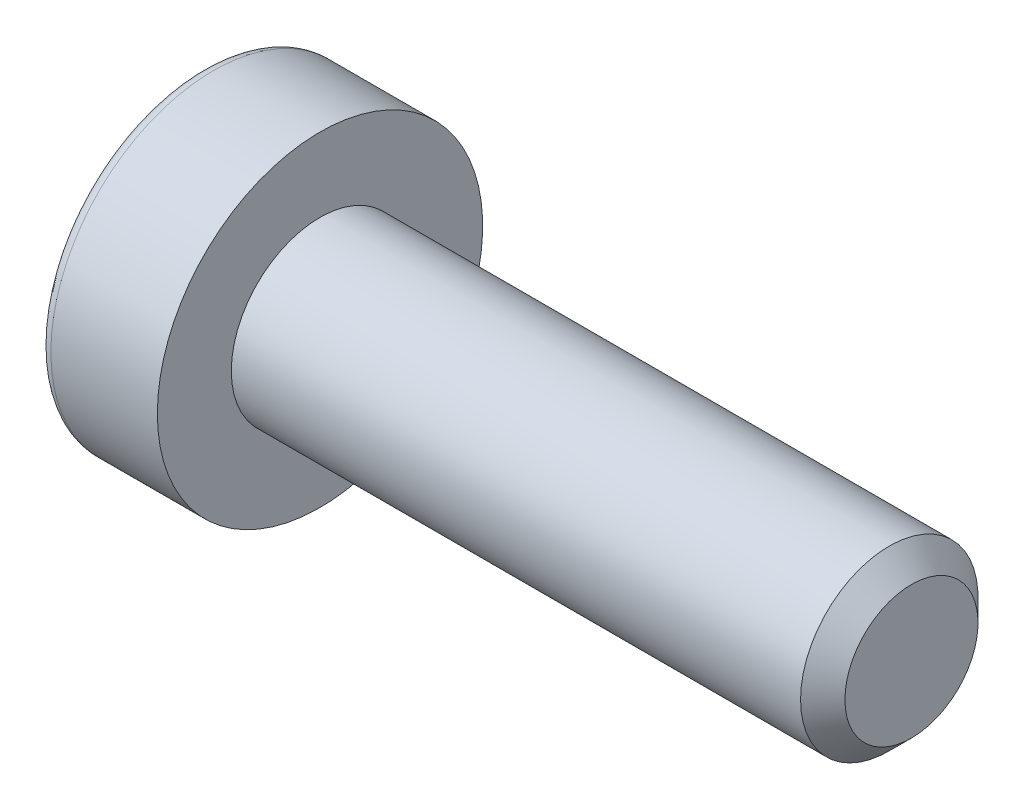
ISO-10303-21;
HEADER;
FILE_DESCRIPTION(('STEP AP214'),'2;1');
FILE_NAME('part.step','',(''),(''),'','','');
FILE_SCHEMA(('AUTOMOTIVE_DESIGN { 1 0 10303 214 1 1 1 1 }'));
ENDSEC;
DATA;
#1=APPLICATION_CONTEXT('core data for automotive mechanical design processes');
#2=APPLICATION_PROTOCOL_DEFINITION('international standard','automotive_design',2000,#1);
#3=PRODUCT_CONTEXT('',#1,'mechanical');
#4=PRODUCT('Part','Part','',(#3));
#5=PRODUCT_RELATED_PRODUCT_CATEGORY('part','',(#4));
#6=PRODUCT_DEFINITION_FORMATION('','',#4);
#7=PRODUCT_DEFINITION_CONTEXT('part definition',#1,'design');
#8=PRODUCT_DEFINITION('design','',#6,#7);
#9=PRODUCT_DEFINITION_SHAPE('','',#8);
#10=(LENGTH_UNIT() NAMED_UNIT(*) SI_UNIT(.MILLI.,.METRE.));
#11=(NAMED_UNIT(*) PLANE_ANGLE_UNIT() SI_UNIT($,.RADIAN.));
#12=(NAMED_UNIT(*) SI_UNIT($,.STERADIAN.) SOLID_ANGLE_UNIT());
#13=UNCERTAINTY_MEASURE_WITH_UNIT(LENGTH_MEASURE(1.E-05),#10,'distance_accuracy_value','');
#14=(GEOMETRIC_REPRESENTATION_CONTEXT(3) GLOBAL_UNCERTAINTY_ASSIGNED_CONTEXT((#13)) GLOBAL_UNIT_ASSIGNED_CONTEXT((#10,
#11,#12)) REPRESENTATION_CONTEXT('',''));
#15=CARTESIAN_POINT('',(0.,0.,0.));
#16=DIRECTION('',(0.,0.,1.));
#17=DIRECTION('',(1.,0.,0.));
#18=AXIS2_PLACEMENT_3D('',#15,#16,#17);
#19=CARTESIAN_POINT('',(0.,2.75000000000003,0.));
#20=DIRECTION('',(1.,0.,0.));
#21=DIRECTION('',(0.,0.,-1.));
#22=AXIS2_PLACEMENT_3D('',#19,#20,#21);
#23=PLANE('',#22);
#24=CARTESIAN_POINT('',(0.,0.,0.));
#25=DIRECTION('',(1.,0.,0.));
#26=DIRECTION('',(0.,0.,-1.));
#27=AXIS2_PLACEMENT_3D('',#24,#25,#26);
#28=CIRCLE('',#27,2.55);
#29=CARTESIAN_POINT('',(0.,0.,-2.55000000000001));
#30=VERTEX_POINT('',#29);
#31=EDGE_CURVE('E31',#30,#30,#28,.F.);
#32=ORIENTED_EDGE('',*,*,#31,.T.);
#33=EDGE_LOOP('',(#32));
#34=FACE_BOUND('',#33,.T.);
#35=DIRECTION('',(0.,-1.,0.));
#36=VECTOR('',#35,1.);
#37=CARTESIAN_POINT('',(0.,0.721687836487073,-1.25000000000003));
#38=LINE('',#37,#36);
#39=CARTESIAN_POINT('',(0.,0.721687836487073,-1.25000000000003));
#40=VERTEX_POINT('',#39);
#41=CARTESIAN_POINT('',(0.,-0.721687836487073,-1.24999999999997));
#42=VERTEX_POINT('',#41);
#43=EDGE_CURVE('E99',#40,#42,#38,.T.);
#44=ORIENTED_EDGE('',*,*,#43,.F.);
#45=DIRECTION('',(0.,-0.499999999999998,-0.866025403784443));
#46=VECTOR('',#45,1.);
#47=CARTESIAN_POINT('',(0.,1.44337567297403,0.));
#48=LINE('',#47,#46);
#49=CARTESIAN_POINT('',(0.,1.44337567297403,0.));
#50=VERTEX_POINT('',#49);
#51=EDGE_CURVE('E38',#50,#40,#48,.T.);
#52=ORIENTED_EDGE('',*,*,#51,.F.);
#53=DIRECTION('',(0.,0.499999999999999,-0.866025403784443));
#54=VECTOR('',#53,1.);
#55=CARTESIAN_POINT('',(0.,1.44337567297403,0.));
#56=LINE('',#55,#54);
#57=CARTESIAN_POINT('',(0.,0.721687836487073,1.25));
#58=VERTEX_POINT('',#57);
#59=EDGE_CURVE('E129',#58,#50,#56,.T.);
#60=ORIENTED_EDGE('',*,*,#59,.F.);
#61=DIRECTION('',(0.,1.,0.));
#62=VECTOR('',#61,1.);
#63=CARTESIAN_POINT('',(0.,0.721687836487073,1.25));
#64=LINE('',#63,#62);
#65=CARTESIAN_POINT('',(0.,-0.721687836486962,1.25));
#66=VERTEX_POINT('',#65);
#67=EDGE_CURVE('E124',#66,#58,#64,.T.);
#68=ORIENTED_EDGE('',*,*,#67,.F.);
#69=DIRECTION('',(0.,0.499999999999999,0.866025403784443));
#70=VECTOR('',#69,1.);
#71=CARTESIAN_POINT('',(0.,-0.721687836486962,1.25));
#72=LINE('',#71,#70);
#73=CARTESIAN_POINT('',(0.,-1.44337567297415,0.));
#74=VERTEX_POINT('',#73);
#75=EDGE_CURVE('E122',#74,#66,#72,.T.);
#76=ORIENTED_EDGE('',*,*,#75,.F.);
#77=DIRECTION('',(0.,-0.499999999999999,0.866025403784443));
#78=VECTOR('',#77,1.);
#79=CARTESIAN_POINT('',(0.,-0.721687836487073,-1.24999999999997));
#80=LINE('',#79,#78);
#81=EDGE_CURVE('E109',#42,#74,#80,.T.);
#82=ORIENTED_EDGE('',*,*,#81,.F.);
#83=EDGE_LOOP('',(#44,#52,#60,#68,#76,#82));
#84=FACE_BOUND('',#83,.T.);
#85=ADVANCED_FACE('F24',(#34,#84),#23,.F.);
#86=CARTESIAN_POINT('',(0.,0.,0.));
#87=DIRECTION('',(-1.,0.,0.));
#88=DIRECTION('',(0.,0.,1.));
#89=AXIS2_PLACEMENT_3D('',#86,#87,#88);
#90=CYLINDRICAL_SURFACE('',#89,2.75);
#91=CARTESIAN_POINT('',(0.199999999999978,0.,0.));
#92=DIRECTION('',(1.,0.,0.));
#93=DIRECTION('',(0.,0.,-1.));
#94=AXIS2_PLACEMENT_3D('',#91,#92,#93);
#95=CIRCLE('',#94,2.75);
#96=CARTESIAN_POINT('',(0.199999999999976,0.,-2.75000000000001));
#97=VERTEX_POINT('',#96);
#98=EDGE_CURVE('E11',#97,#97,#95,.T.);
#99=ORIENTED_EDGE('',*,*,#98,.T.);
#100=EDGE_LOOP('',(#99));
#101=FACE_BOUND('',#100,.T.);
#102=CARTESIAN_POINT('',(2.,0.,0.));
#103=DIRECTION('',(-1.,0.,0.));
#104=DIRECTION('',(0.,0.,1.));
#105=AXIS2_PLACEMENT_3D('',#102,#103,#104);
#106=CIRCLE('',#105,2.75);
#107=CARTESIAN_POINT('',(2.,0.,2.75000000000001));
#108=VERTEX_POINT('',#107);
#109=EDGE_CURVE('E169',#108,#108,#106,.T.);
#110=ORIENTED_EDGE('',*,*,#109,.T.);
#111=EDGE_LOOP('',(#110));
#112=FACE_BOUND('',#111,.T.);
#113=ADVANCED_FACE('F196',(#101,#112),#90,.T.);
#114=CARTESIAN_POINT('',(2.,1.49999999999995,0.));
#115=DIRECTION('',(-1.,0.,0.));
#116=DIRECTION('',(0.,0.,1.));
#117=AXIS2_PLACEMENT_3D('',#114,#115,#116);
#118=PLANE('',#117);
#119=ORIENTED_EDGE('',*,*,#109,.F.);
#120=EDGE_LOOP('',(#119));
#121=FACE_BOUND('',#120,.T.);
#122=CARTESIAN_POINT('',(2.,0.,0.));
#123=DIRECTION('',(-1.,0.,0.));
#124=DIRECTION('',(0.,0.,1.));
#125=AXIS2_PLACEMENT_3D('',#122,#123,#124);
#126=CIRCLE('',#125,1.5);
#127=CARTESIAN_POINT('',(2.,0.,1.50000000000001));
#128=VERTEX_POINT('',#127);
#129=EDGE_CURVE('E165',#128,#128,#126,.T.);
#130=ORIENTED_EDGE('',*,*,#129,.T.);
#131=EDGE_LOOP('',(#130));
#132=FACE_BOUND('',#131,.T.);
#133=ADVANCED_FACE('F201',(#121,#132),#118,.F.);
#134=CARTESIAN_POINT('',(0.,0.,0.));
#135=DIRECTION('',(-1.,0.,0.));
#136=DIRECTION('',(0.,0.,1.));
#137=AXIS2_PLACEMENT_3D('',#134,#135,#136);
#138=CYLINDRICAL_SURFACE('',#137,1.5);
#139=CARTESIAN_POINT('',(11.625,0.,0.));
#140=DIRECTION('',(-1.,0.,0.));
#141=DIRECTION('',(0.,0.,1.));
#142=AXIS2_PLACEMENT_3D('',#139,#140,#141);
#143=CIRCLE('',#142,1.5);
#144=CARTESIAN_POINT('',(11.625,0.,1.50000000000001));
#145=VERTEX_POINT('',#144);
#146=EDGE_CURVE('E172',#145,#145,#143,.T.);
#147=ORIENTED_EDGE('',*,*,#146,.T.);
#148=EDGE_LOOP('',(#147));
#149=FACE_BOUND('',#148,.T.);
#150=ORIENTED_EDGE('',*,*,#129,.F.);
#151=EDGE_LOOP('',(#150));
#152=FACE_BOUND('',#151,.T.);
#153=ADVANCED_FACE('F206',(#149,#152),#138,.T.);
#154=CARTESIAN_POINT('',(12.,0.,0.));
#155=DIRECTION('',(-1.,0.,0.));
#156=DIRECTION('',(0.,0.,1.));
#157=AXIS2_PLACEMENT_3D('',#154,#155,#156);
#158=PLANE('',#157);
#159=CARTESIAN_POINT('',(12.,0.,0.));
#160=DIRECTION('',(-1.,0.,0.));
#161=DIRECTION('',(0.,0.,1.));
#162=AXIS2_PLACEMENT_3D('',#159,#160,#161);
#163=CIRCLE('',#162,1.125);
#164=CARTESIAN_POINT('',(12.,0.,1.125));
#165=VERTEX_POINT('',#164);
#166=EDGE_CURVE('E175',#165,#165,#163,.F.);
#167=ORIENTED_EDGE('',*,*,#166,.T.);
#168=EDGE_LOOP('',(#167));
#169=FACE_BOUND('',#168,.T.);
#170=ADVANCED_FACE('F213',(#169),#158,.F.);
#171=CARTESIAN_POINT('',(11.625,0.,0.));
#172=DIRECTION('',(-1.,0.,0.));
#173=DIRECTION('',(0.,0.,1.));
#174=AXIS2_PLACEMENT_3D('',#171,#172,#173);
#175=CONICAL_SURFACE('',#174,1.5,0.785398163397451);
#176=ORIENTED_EDGE('',*,*,#166,.F.);
#177=EDGE_LOOP('',(#176));
#178=FACE_BOUND('',#177,.T.);
#179=ORIENTED_EDGE('',*,*,#146,.F.);
#180=EDGE_LOOP('',(#179));
#181=FACE_BOUND('',#180,.T.);
#182=ADVANCED_FACE('F217',(#178,#181),#175,.T.);
#183=CARTESIAN_POINT('',(1.,1.44337567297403,0.));
#184=DIRECTION('',(0.,0.866025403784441,-0.499999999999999));
#185=DIRECTION('',(0.,0.499999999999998,0.866025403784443));
#186=AXIS2_PLACEMENT_3D('',#183,#184,#185);
#187=PLANE('',#186);
#188=DIRECTION('',(0.,-0.499999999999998,-0.866025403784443));
#189=VECTOR('',#188,1.);
#190=CARTESIAN_POINT('',(1.,1.44337567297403,0.));
#191=LINE('',#190,#189);
#192=CARTESIAN_POINT('',(1.,1.44337567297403,0.));
#193=VERTEX_POINT('',#192);
#194=CARTESIAN_POINT('',(1.,1.08253175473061,-0.625000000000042));
#195=VERTEX_POINT('',#194);
#196=EDGE_CURVE('E132',#193,#195,#191,.T.);
#197=ORIENTED_EDGE('',*,*,#196,.F.);
#198=DIRECTION('',(-1.,0.,0.));
#199=VECTOR('',#198,1.);
#200=CARTESIAN_POINT('',(1.,1.44337567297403,0.));
#201=LINE('',#200,#199);
#202=EDGE_CURVE('E151',#193,#50,#201,.T.);
#203=ORIENTED_EDGE('',*,*,#202,.T.);
#204=ORIENTED_EDGE('',*,*,#51,.T.);
#205=DIRECTION('',(-1.,0.,0.));
#206=VECTOR('',#205,1.);
#207=CARTESIAN_POINT('',(1.,0.721687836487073,-1.25000000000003));
#208=LINE('',#207,#206);
#209=CARTESIAN_POINT('',(1.,0.721687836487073,-1.25000000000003));
#210=VERTEX_POINT('',#209);
#211=EDGE_CURVE('E106',#210,#40,#208,.T.);
#212=ORIENTED_EDGE('',*,*,#211,.F.);
#213=EDGE_CURVE('E131',#195,#210,#191,.T.);
#214=ORIENTED_EDGE('',*,*,#213,.F.);
#215=EDGE_LOOP('',(#197,#203,#204,#212,#214));
#216=FACE_BOUND('',#215,.T.);
#217=ADVANCED_FACE('F219',(#216),#187,.F.);
#218=CARTESIAN_POINT('',(1.,1.44337567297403,0.));
#219=DIRECTION('',(0.,0.866025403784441,0.499999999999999));
#220=DIRECTION('',(0.,-0.499999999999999,0.866025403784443));
#221=AXIS2_PLACEMENT_3D('',#218,#219,#220);
#222=PLANE('',#221);
#223=DIRECTION('',(0.,0.499999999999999,-0.866025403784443));
#224=VECTOR('',#223,1.);
#225=CARTESIAN_POINT('',(1.,1.44337567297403,0.));
#226=LINE('',#225,#224);
#227=CARTESIAN_POINT('',(1.,0.721687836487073,1.25));
#228=VERTEX_POINT('',#227);
#229=CARTESIAN_POINT('',(1.,1.08253175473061,0.625000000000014));
#230=VERTEX_POINT('',#229);
#231=EDGE_CURVE('E148',#228,#230,#226,.T.);
#232=ORIENTED_EDGE('',*,*,#231,.F.);
#233=DIRECTION('',(-1.,0.,0.));
#234=VECTOR('',#233,1.);
#235=CARTESIAN_POINT('',(1.,0.721687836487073,1.25));
#236=LINE('',#235,#234);
#237=EDGE_CURVE('E154',#228,#58,#236,.T.);
#238=ORIENTED_EDGE('',*,*,#237,.T.);
#239=ORIENTED_EDGE('',*,*,#59,.T.);
#240=ORIENTED_EDGE('',*,*,#202,.F.);
#241=EDGE_CURVE('E147',#230,#193,#226,.T.);
#242=ORIENTED_EDGE('',*,*,#241,.F.);
#243=EDGE_LOOP('',(#232,#238,#239,#240,#242));
#244=FACE_BOUND('',#243,.T.);
#245=ADVANCED_FACE('F224',(#244),#222,.F.);
#246=CARTESIAN_POINT('',(1.,0.721687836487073,1.25));
#247=DIRECTION('',(0.,0.,1.));
#248=DIRECTION('',(1.,0.,0.));
#249=AXIS2_PLACEMENT_3D('',#246,#247,#248);
#250=PLANE('',#249);
#251=DIRECTION('',(0.,1.,0.));
#252=VECTOR('',#251,1.);
#253=CARTESIAN_POINT('',(1.,0.721687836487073,1.25));
#254=LINE('',#253,#252);
#255=CARTESIAN_POINT('',(1.,-0.721687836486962,1.25));
#256=VERTEX_POINT('',#255);
#257=CARTESIAN_POINT('',(1.,0.,1.24999999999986));
#258=VERTEX_POINT('',#257);
#259=EDGE_CURVE('E46',#256,#258,#254,.T.);
#260=ORIENTED_EDGE('',*,*,#259,.F.);
#261=DIRECTION('',(-1.,0.,0.));
#262=VECTOR('',#261,1.);
#263=CARTESIAN_POINT('',(1.,-0.721687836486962,1.25));
#264=LINE('',#263,#262);
#265=EDGE_CURVE('E157',#256,#66,#264,.T.);
#266=ORIENTED_EDGE('',*,*,#265,.T.);
#267=ORIENTED_EDGE('',*,*,#67,.T.);
#268=ORIENTED_EDGE('',*,*,#237,.F.);
#269=EDGE_CURVE('E145',#258,#228,#254,.T.);
#270=ORIENTED_EDGE('',*,*,#269,.F.);
#271=EDGE_LOOP('',(#260,#266,#267,#268,#270));
#272=FACE_BOUND('',#271,.T.);
#273=ADVANCED_FACE('F233',(#272),#250,.F.);
#274=CARTESIAN_POINT('',(1.,-0.721687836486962,1.25));
#275=DIRECTION('',(0.,-0.866025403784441,0.500000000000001));
#276=DIRECTION('',(0.,-0.499999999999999,-0.866025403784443));
#277=AXIS2_PLACEMENT_3D('',#274,#275,#276);
#278=PLANE('',#277);
#279=DIRECTION('',(0.,0.499999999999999,0.866025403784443));
#280=VECTOR('',#279,1.);
#281=CARTESIAN_POINT('',(1.,-0.721687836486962,1.25));
#282=LINE('',#281,#280);
#283=CARTESIAN_POINT('',(1.,-1.44337567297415,0.));
#284=VERTEX_POINT('',#283);
#285=CARTESIAN_POINT('',(1.,-1.08253175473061,0.624999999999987));
#286=VERTEX_POINT('',#285);
#287=EDGE_CURVE('E142',#284,#286,#282,.T.);
#288=ORIENTED_EDGE('',*,*,#287,.F.);
#289=DIRECTION('',(-1.,0.,0.));
#290=VECTOR('',#289,1.);
#291=CARTESIAN_POINT('',(1.,-1.44337567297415,0.));
#292=LINE('',#291,#290);
#293=EDGE_CURVE('E118',#284,#74,#292,.T.);
#294=ORIENTED_EDGE('',*,*,#293,.T.);
#295=ORIENTED_EDGE('',*,*,#75,.T.);
#296=ORIENTED_EDGE('',*,*,#265,.F.);
#297=EDGE_CURVE('E141',#286,#256,#282,.T.);
#298=ORIENTED_EDGE('',*,*,#297,.F.);
#299=EDGE_LOOP('',(#288,#294,#295,#296,#298));
#300=FACE_BOUND('',#299,.T.);
#301=ADVANCED_FACE('F230',(#300),#278,.F.);
#302=CARTESIAN_POINT('',(1.,-0.721687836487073,-1.24999999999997));
#303=DIRECTION('',(0.,-0.86602540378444,-0.5));
#304=DIRECTION('',(0.,0.499999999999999,-0.866025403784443));
#305=AXIS2_PLACEMENT_3D('',#302,#303,#304);
#306=PLANE('',#305);
#307=DIRECTION('',(0.,-0.499999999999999,0.866025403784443));
#308=VECTOR('',#307,1.);
#309=CARTESIAN_POINT('',(1.,-0.721687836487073,-1.24999999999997));
#310=LINE('',#309,#308);
#311=CARTESIAN_POINT('',(1.,-0.721687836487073,-1.24999999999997));
#312=VERTEX_POINT('',#311);
#313=CARTESIAN_POINT('',(1.,-1.0825317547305,-0.62500000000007));
#314=VERTEX_POINT('',#313);
#315=EDGE_CURVE('E117',#312,#314,#310,.T.);
#316=ORIENTED_EDGE('',*,*,#315,.F.);
#317=DIRECTION('',(-1.,0.,0.));
#318=VECTOR('',#317,1.);
#319=CARTESIAN_POINT('',(1.,-0.721687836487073,-1.24999999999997));
#320=LINE('',#319,#318);
#321=EDGE_CURVE('E104',#312,#42,#320,.T.);
#322=ORIENTED_EDGE('',*,*,#321,.T.);
#323=ORIENTED_EDGE('',*,*,#81,.T.);
#324=ORIENTED_EDGE('',*,*,#293,.F.);
#325=EDGE_CURVE('E139',#314,#284,#310,.T.);
#326=ORIENTED_EDGE('',*,*,#325,.F.);
#327=EDGE_LOOP('',(#316,#322,#323,#324,#326));
#328=FACE_BOUND('',#327,.T.);
#329=ADVANCED_FACE('F112',(#328),#306,.F.);
#330=CARTESIAN_POINT('',(1.,0.721687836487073,-1.25000000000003));
#331=DIRECTION('',(0.,0.,-1.));
#332=DIRECTION('',(-1.,0.,0.));
#333=AXIS2_PLACEMENT_3D('',#330,#331,#332);
#334=PLANE('',#333);
#335=DIRECTION('',(0.,-1.,0.));
#336=VECTOR('',#335,1.);
#337=CARTESIAN_POINT('',(1.,0.721687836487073,-1.25000000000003));
#338=LINE('',#337,#336);
#339=CARTESIAN_POINT('',(1.,3.33066907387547E-13,-1.25000000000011));
#340=VERTEX_POINT('',#339);
#341=EDGE_CURVE('E136',#210,#340,#338,.T.);
#342=ORIENTED_EDGE('',*,*,#341,.F.);
#343=ORIENTED_EDGE('',*,*,#211,.T.);
#344=ORIENTED_EDGE('',*,*,#43,.T.);
#345=ORIENTED_EDGE('',*,*,#321,.F.);
#346=EDGE_CURVE('E135',#340,#312,#338,.T.);
#347=ORIENTED_EDGE('',*,*,#346,.F.);
#348=EDGE_LOOP('',(#342,#343,#344,#345,#347));
#349=FACE_BOUND('',#348,.T.);
#350=ADVANCED_FACE('F102',(#349),#334,.F.);
#351=CARTESIAN_POINT('',(1.,0.721687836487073,-1.25000000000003));
#352=DIRECTION('',(-1.,0.,0.));
#353=DIRECTION('',(0.,0.,1.));
#354=AXIS2_PLACEMENT_3D('',#351,#352,#353);
#355=PLANE('',#354);
#356=ORIENTED_EDGE('',*,*,#269,.T.);
#357=ORIENTED_EDGE('',*,*,#231,.T.);
#358=CARTESIAN_POINT('',(1.,0.,0.));
#359=DIRECTION('',(-1.,0.,0.));
#360=DIRECTION('',(0.,0.,1.));
#361=AXIS2_PLACEMENT_3D('',#358,#359,#360);
#362=CIRCLE('',#361,1.25);
#363=EDGE_CURVE('E162',#258,#230,#362,.T.);
#364=ORIENTED_EDGE('',*,*,#363,.F.);
#365=EDGE_LOOP('',(#356,#357,#364));
#366=FACE_BOUND('',#365,.T.);
#367=ADVANCED_FACE('F227',(#366),#355,.T.);
#368=ORIENTED_EDGE('',*,*,#241,.T.);
#369=ORIENTED_EDGE('',*,*,#196,.T.);
#370=EDGE_CURVE('E166',#230,#195,#362,.T.);
#371=ORIENTED_EDGE('',*,*,#370,.F.);
#372=EDGE_LOOP('',(#368,#369,#371));
#373=FACE_BOUND('',#372,.T.);
#374=ADVANCED_FACE('F247',(#373),#355,.T.);
#375=ORIENTED_EDGE('',*,*,#213,.T.);
#376=ORIENTED_EDGE('',*,*,#341,.T.);
#377=EDGE_CURVE('E264',#195,#340,#362,.T.);
#378=ORIENTED_EDGE('',*,*,#377,.F.);
#379=EDGE_LOOP('',(#375,#376,#378));
#380=FACE_BOUND('',#379,.T.);
#381=ADVANCED_FACE('F252',(#380),#355,.T.);
#382=ORIENTED_EDGE('',*,*,#346,.T.);
#383=ORIENTED_EDGE('',*,*,#315,.T.);
#384=EDGE_CURVE('E265',#340,#314,#362,.T.);
#385=ORIENTED_EDGE('',*,*,#384,.F.);
#386=EDGE_LOOP('',(#382,#383,#385));
#387=FACE_BOUND('',#386,.T.);
#388=ADVANCED_FACE('F244',(#387),#355,.T.);
#389=ORIENTED_EDGE('',*,*,#325,.T.);
#390=ORIENTED_EDGE('',*,*,#287,.T.);
#391=EDGE_CURVE('E267',#314,#286,#362,.T.);
#392=ORIENTED_EDGE('',*,*,#391,.F.);
#393=EDGE_LOOP('',(#389,#390,#392));
#394=FACE_BOUND('',#393,.T.);
#395=ADVANCED_FACE('F240',(#394),#355,.T.);
#396=ORIENTED_EDGE('',*,*,#297,.T.);
#397=ORIENTED_EDGE('',*,*,#259,.T.);
#398=EDGE_CURVE('E153',#286,#258,#362,.T.);
#399=ORIENTED_EDGE('',*,*,#398,.F.);
#400=EDGE_LOOP('',(#396,#397,#399));
#401=FACE_BOUND('',#400,.T.);
#402=ADVANCED_FACE('F190',(#401),#355,.T.);
#403=CARTESIAN_POINT('',(1.80000000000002,0.,0.));
#404=DIRECTION('',(-1.,0.,0.));
#405=DIRECTION('',(0.,0.,1.));
#406=AXIS2_PLACEMENT_3D('',#403,#404,#405);
#407=CONICAL_SURFACE('',#406,0.,1.00148313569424);
#408=ORIENTED_EDGE('',*,*,#363,.T.);
#409=ORIENTED_EDGE('',*,*,#370,.T.);
#410=ORIENTED_EDGE('',*,*,#377,.T.);
#411=ORIENTED_EDGE('',*,*,#384,.T.);
#412=ORIENTED_EDGE('',*,*,#391,.T.);
#413=ORIENTED_EDGE('',*,*,#398,.T.);
#414=EDGE_LOOP('',(#408,#409,#410,#411,#412,#413));
#415=FACE_BOUND('',#414,.T.);
#416=CARTESIAN_POINT('',(1.80000000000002,0.,0.));
#417=VERTEX_POINT('',#416);
#418=VERTEX_LOOP('',#417);
#419=FACE_BOUND('',#418,.T.);
#420=ADVANCED_FACE('F183',(#415,#419),#407,.F.);
#421=CARTESIAN_POINT('',(0.199999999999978,0.,0.));
#422=DIRECTION('',(1.,0.,0.));
#423=DIRECTION('',(0.,0.,-1.));
#424=AXIS2_PLACEMENT_3D('',#421,#422,#423);
#425=TOROIDAL_SURFACE('',#424,2.55,0.2);
#426=ORIENTED_EDGE('',*,*,#98,.F.);
#427=EDGE_LOOP('',(#426));
#428=FACE_BOUND('',#427,.T.);
#429=ORIENTED_EDGE('',*,*,#31,.F.);
#430=EDGE_LOOP('',(#429));
#431=FACE_BOUND('',#430,.T.);
#432=ADVANCED_FACE('F181',(#428,#431),#425,.T.);
#433=CLOSED_SHELL('',(#85,#113,#133,#153,#170,#182,#217,#245,#273,#301,#329,#350,#367,#374,#381,
#388,#395,#402,#420,#432));
#434=MANIFOLD_SOLID_BREP('B2',#433);
#435=ADVANCED_BREP_SHAPE_REPRESENTATION('',(#18,#434),#14);
#436=SHAPE_DEFINITION_REPRESENTATION(#9,#435);
ENDSEC;
END-ISO-10303-21;
